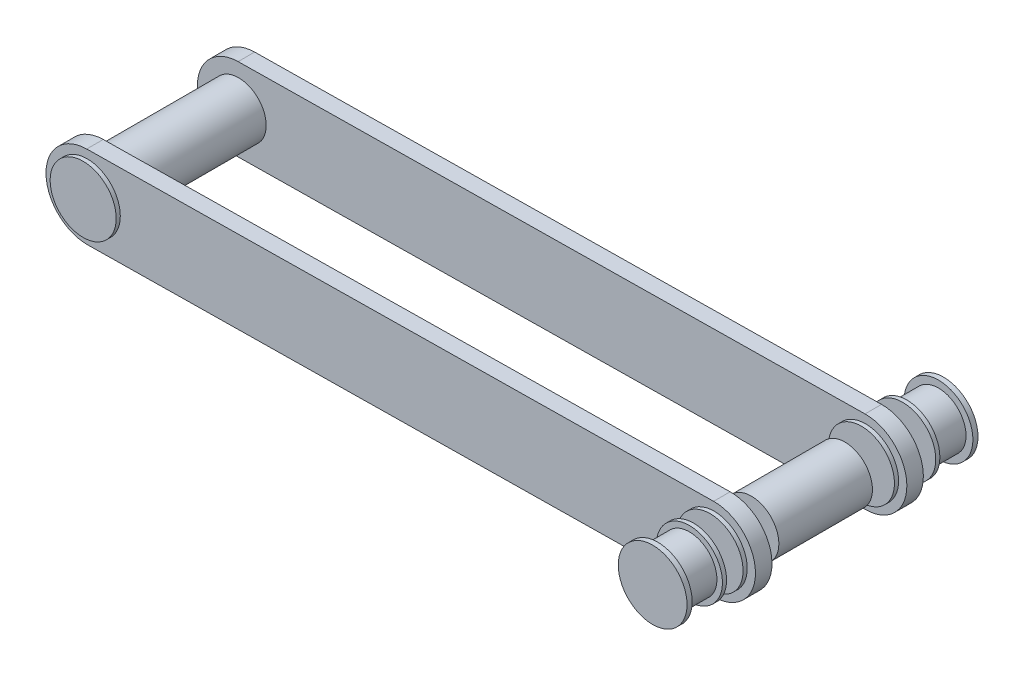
ISO-10303-21;
HEADER;
FILE_DESCRIPTION(('STEP AP214'),'2;1');
FILE_NAME('part.step','',(''),(''),'','','');
FILE_SCHEMA(('AUTOMOTIVE_DESIGN { 1 0 10303 214 1 1 1 1 }'));
ENDSEC;
DATA;
#1=APPLICATION_CONTEXT('core data for automotive mechanical design processes');
#2=APPLICATION_PROTOCOL_DEFINITION('international standard','automotive_design',2000,#1);
#3=PRODUCT_CONTEXT('',#1,'mechanical');
#4=PRODUCT('Part','Part','',(#3));
#5=PRODUCT_RELATED_PRODUCT_CATEGORY('part','',(#4));
#6=PRODUCT_DEFINITION_FORMATION('','',#4);
#7=PRODUCT_DEFINITION_CONTEXT('part definition',#1,'design');
#8=PRODUCT_DEFINITION('design','',#6,#7);
#9=PRODUCT_DEFINITION_SHAPE('','',#8);
#10=(LENGTH_UNIT() NAMED_UNIT(*) SI_UNIT(.MILLI.,.METRE.));
#11=(NAMED_UNIT(*) PLANE_ANGLE_UNIT() SI_UNIT($,.RADIAN.));
#12=(NAMED_UNIT(*) SI_UNIT($,.STERADIAN.) SOLID_ANGLE_UNIT());
#13=UNCERTAINTY_MEASURE_WITH_UNIT(LENGTH_MEASURE(1.E-05),#10,'distance_accuracy_value','');
#14=(GEOMETRIC_REPRESENTATION_CONTEXT(3) GLOBAL_UNCERTAINTY_ASSIGNED_CONTEXT((#13)) GLOBAL_UNIT_ASSIGNED_CONTEXT((#10,
#11,#12)) REPRESENTATION_CONTEXT('',''));
#15=CARTESIAN_POINT('',(0.,0.,0.));
#16=DIRECTION('',(0.,0.,1.));
#17=DIRECTION('',(1.,0.,0.));
#18=AXIS2_PLACEMENT_3D('',#15,#16,#17);
#19=CARTESIAN_POINT('',(244.185614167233,302.725459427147,50.9999999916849));
#20=DIRECTION('',(0.,0.,1.));
#21=DIRECTION('',(1.,0.,0.));
#22=AXIS2_PLACEMENT_3D('',#19,#20,#21);
#23=PLANE('',#22);
#24=CARTESIAN_POINT('',(244.185614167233,302.725459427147,50.9999999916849));
#25=DIRECTION('',(0.,0.,-1.));
#26=DIRECTION('',(-1.,0.,0.));
#27=AXIS2_PLACEMENT_3D('',#24,#25,#26);
#28=CIRCLE('',#27,10.0000004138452);
#29=CARTESIAN_POINT('',(234.185613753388,302.725459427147,50.9999999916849));
#30=VERTEX_POINT('',#29);
#31=EDGE_CURVE('P0_E10',#30,#30,#28,.T.);
#32=ORIENTED_EDGE('',*,*,#31,.F.);
#33=EDGE_LOOP('',(#32));
#34=FACE_BOUND('',#33,.T.);
#35=ADVANCED_FACE('P0_F14',(#34),#23,.T.);
#36=CARTESIAN_POINT('',(244.185614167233,302.725459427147,39.4999999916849));
#37=DIRECTION('',(0.,0.,-1.));
#38=DIRECTION('',(-1.,0.,0.));
#39=AXIS2_PLACEMENT_3D('',#36,#37,#38);
#40=PLANE('',#39);
#41=CARTESIAN_POINT('',(244.185614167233,302.725459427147,39.4999999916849));
#42=DIRECTION('',(0.,0.,1.));
#43=DIRECTION('',(1.,0.,0.));
#44=AXIS2_PLACEMENT_3D('',#41,#42,#43);
#45=CIRCLE('',#44,10.0000004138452);
#46=CARTESIAN_POINT('',(254.185614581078,302.725459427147,39.4999999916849));
#47=VERTEX_POINT('',#46);
#48=EDGE_CURVE('P0_E21',#47,#47,#45,.T.);
#49=ORIENTED_EDGE('',*,*,#48,.F.);
#50=EDGE_LOOP('',(#49));
#51=FACE_BOUND('',#50,.T.);
#52=ADVANCED_FACE('P0_F28',(#51),#40,.T.);
#53=CARTESIAN_POINT('',(244.185614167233,302.725459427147,39.4999999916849));
#54=DIRECTION('',(0.,0.,1.));
#55=DIRECTION('',(1.,0.,0.));
#56=AXIS2_PLACEMENT_3D('',#53,#54,#55);
#57=CYLINDRICAL_SURFACE('',#56,10.0000004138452);
#58=ORIENTED_EDGE('',*,*,#31,.T.);
#59=EDGE_LOOP('',(#58));
#60=FACE_BOUND('',#59,.T.);
#61=ORIENTED_EDGE('',*,*,#48,.T.);
#62=EDGE_LOOP('',(#61));
#63=FACE_BOUND('',#62,.T.);
#64=ADVANCED_FACE('P0_F16',(#60,#63),#57,.T.);
#65=CLOSED_SHELL('',(#35,#52,#64));
#66=MANIFOLD_SOLID_BREP('P0_B1',#65);
#67=CARTESIAN_POINT('',(244.185614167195,302.725459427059,-24.5000000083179));
#68=DIRECTION('',(0.,0.,-1.));
#69=DIRECTION('',(-1.,0.,0.));
#70=AXIS2_PLACEMENT_3D('',#67,#68,#69);
#71=PLANE('',#70);
#72=CARTESIAN_POINT('',(244.185614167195,302.725459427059,-24.5000000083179));
#73=DIRECTION('',(0.,0.,1.));
#74=DIRECTION('',(1.,0.,0.));
#75=AXIS2_PLACEMENT_3D('',#72,#73,#74);
#76=CIRCLE('',#75,12.0000004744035);
#77=CARTESIAN_POINT('',(256.185614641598,302.725459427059,-24.5000000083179));
#78=VERTEX_POINT('',#77);
#79=EDGE_CURVE('P1_E10',#78,#78,#76,.T.);
#80=ORIENTED_EDGE('',*,*,#79,.F.);
#81=EDGE_LOOP('',(#80));
#82=FACE_BOUND('',#81,.T.);
#83=ADVANCED_FACE('P1_F14',(#82),#71,.T.);
#84=CARTESIAN_POINT('',(244.185614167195,302.725459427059,-23.0000000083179));
#85=DIRECTION('',(0.,0.,1.));
#86=DIRECTION('',(1.,0.,0.));
#87=AXIS2_PLACEMENT_3D('',#84,#85,#86);
#88=PLANE('',#87);
#89=CARTESIAN_POINT('',(244.185614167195,302.725459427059,-23.0000000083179));
#90=DIRECTION('',(0.,0.,-1.));
#91=DIRECTION('',(-1.,0.,0.));
#92=AXIS2_PLACEMENT_3D('',#89,#90,#91);
#93=CIRCLE('',#92,12.0000004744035);
#94=CARTESIAN_POINT('',(232.185613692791,302.725459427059,-23.000000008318));
#95=VERTEX_POINT('',#94);
#96=EDGE_CURVE('P1_E21',#95,#95,#93,.T.);
#97=ORIENTED_EDGE('',*,*,#96,.F.);
#98=EDGE_LOOP('',(#97));
#99=FACE_BOUND('',#98,.T.);
#100=ADVANCED_FACE('P1_F28',(#99),#88,.T.);
#101=CARTESIAN_POINT('',(244.185614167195,302.725459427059,-23.0000000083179));
#102=DIRECTION('',(0.,0.,-1.));
#103=DIRECTION('',(-1.,0.,0.));
#104=AXIS2_PLACEMENT_3D('',#101,#102,#103);
#105=CYLINDRICAL_SURFACE('',#104,12.0000004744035);
#106=ORIENTED_EDGE('',*,*,#79,.T.);
#107=EDGE_LOOP('',(#106));
#108=FACE_BOUND('',#107,.T.);
#109=ORIENTED_EDGE('',*,*,#96,.T.);
#110=EDGE_LOOP('',(#109));
#111=FACE_BOUND('',#110,.T.);
#112=ADVANCED_FACE('P1_F16',(#108,#111),#105,.T.);
#113=CLOSED_SHELL('',(#83,#100,#112));
#114=MANIFOLD_SOLID_BREP('P1_B1',#113);
#115=CARTESIAN_POINT('',(244.185614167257,302.725459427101,16.9999999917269));
#116=DIRECTION('',(0.,0.,1.));
#117=DIRECTION('',(1.,0.,0.));
#118=AXIS2_PLACEMENT_3D('',#115,#116,#117);
#119=PLANE('',#118);
#120=CARTESIAN_POINT('',(244.185614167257,302.725459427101,16.9999999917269));
#121=DIRECTION('',(0.,0.,-1.));
#122=DIRECTION('',(-1.,0.,0.));
#123=AXIS2_PLACEMENT_3D('',#120,#121,#122);
#124=CIRCLE('',#123,10.0000004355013);
#125=CARTESIAN_POINT('',(234.185613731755,302.725459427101,16.9999999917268));
#126=VERTEX_POINT('',#125);
#127=EDGE_CURVE('P2_E10',#126,#126,#124,.T.);
#128=ORIENTED_EDGE('',*,*,#127,.F.);
#129=EDGE_LOOP('',(#128));
#130=FACE_BOUND('',#129,.T.);
#131=ADVANCED_FACE('P2_F14',(#130),#119,.T.);
#132=CARTESIAN_POINT('',(244.185614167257,302.725459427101,-17.0000000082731));
#133=DIRECTION('',(0.,0.,-1.));
#134=DIRECTION('',(-1.,0.,0.));
#135=AXIS2_PLACEMENT_3D('',#132,#133,#134);
#136=PLANE('',#135);
#137=CARTESIAN_POINT('',(244.185614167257,302.725459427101,-17.0000000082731));
#138=DIRECTION('',(0.,0.,1.));
#139=DIRECTION('',(1.,0.,0.));
#140=AXIS2_PLACEMENT_3D('',#137,#138,#139);
#141=CIRCLE('',#140,10.0000004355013);
#142=CARTESIAN_POINT('',(254.185614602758,302.725459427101,-17.0000000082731));
#143=VERTEX_POINT('',#142);
#144=EDGE_CURVE('P2_E21',#143,#143,#141,.T.);
#145=ORIENTED_EDGE('',*,*,#144,.F.);
#146=EDGE_LOOP('',(#145));
#147=FACE_BOUND('',#146,.T.);
#148=ADVANCED_FACE('P2_F28',(#147),#136,.T.);
#149=CARTESIAN_POINT('',(244.185614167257,302.725459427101,-17.0000000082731));
#150=DIRECTION('',(0.,0.,1.));
#151=DIRECTION('',(1.,0.,0.));
#152=AXIS2_PLACEMENT_3D('',#149,#150,#151);
#153=CYLINDRICAL_SURFACE('',#152,10.0000004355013);
#154=ORIENTED_EDGE('',*,*,#127,.T.);
#155=EDGE_LOOP('',(#154));
#156=FACE_BOUND('',#155,.T.);
#157=ORIENTED_EDGE('',*,*,#144,.T.);
#158=EDGE_LOOP('',(#157));
#159=FACE_BOUND('',#158,.T.);
#160=ADVANCED_FACE('P2_F16',(#156,#159),#153,.T.);
#161=CLOSED_SHELL('',(#131,#148,#160));
#162=MANIFOLD_SOLID_BREP('P2_B1',#161);
#163=CARTESIAN_POINT('',(244.185614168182,302.725459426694,-51.0000000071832));
#164=DIRECTION('',(0.,0.,1.));
#165=DIRECTION('',(1.,0.,0.));
#166=AXIS2_PLACEMENT_3D('',#163,#164,#165);
#167=PLANE('',#166);
#168=CARTESIAN_POINT('',(244.185614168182,302.725459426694,-51.0000000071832));
#169=DIRECTION('',(0.,0.,-1.));
#170=DIRECTION('',(-1.,0.,0.));
#171=AXIS2_PLACEMENT_3D('',#168,#169,#170);
#172=CIRCLE('',#171,12.5000004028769);
#173=CARTESIAN_POINT('',(231.685613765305,302.725459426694,-51.0000000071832));
#174=VERTEX_POINT('',#173);
#175=EDGE_CURVE('P3_E10',#174,#174,#172,.T.);
#176=ORIENTED_EDGE('',*,*,#175,.F.);
#177=EDGE_LOOP('',(#176));
#178=FACE_BOUND('',#177,.T.);
#179=ADVANCED_FACE('P3_F14',(#178),#167,.T.);
#180=CARTESIAN_POINT('',(244.185614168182,302.725459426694,-52.8522413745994));
#181=DIRECTION('',(0.,0.,-1.));
#182=DIRECTION('',(-1.,0.,0.));
#183=AXIS2_PLACEMENT_3D('',#180,#181,#182);
#184=PLANE('',#183);
#185=CARTESIAN_POINT('',(244.185614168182,302.725459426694,-52.8522413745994));
#186=DIRECTION('',(0.,0.,1.));
#187=DIRECTION('',(1.,0.,0.));
#188=AXIS2_PLACEMENT_3D('',#185,#186,#187);
#189=CIRCLE('',#188,12.5000004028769);
#190=CARTESIAN_POINT('',(256.685614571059,302.725459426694,-52.8522413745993));
#191=VERTEX_POINT('',#190);
#192=EDGE_CURVE('P3_E21',#191,#191,#189,.T.);
#193=ORIENTED_EDGE('',*,*,#192,.F.);
#194=EDGE_LOOP('',(#193));
#195=FACE_BOUND('',#194,.T.);
#196=ADVANCED_FACE('P3_F28',(#195),#184,.T.);
#197=CARTESIAN_POINT('',(244.185614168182,302.725459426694,-52.8522413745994));
#198=DIRECTION('',(0.,0.,1.));
#199=DIRECTION('',(1.,0.,0.));
#200=AXIS2_PLACEMENT_3D('',#197,#198,#199);
#201=CYLINDRICAL_SURFACE('',#200,12.5000004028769);
#202=ORIENTED_EDGE('',*,*,#175,.T.);
#203=EDGE_LOOP('',(#202));
#204=FACE_BOUND('',#203,.T.);
#205=ORIENTED_EDGE('',*,*,#192,.T.);
#206=EDGE_LOOP('',(#205));
#207=FACE_BOUND('',#206,.T.);
#208=ADVANCED_FACE('P3_F16',(#204,#207),#201,.T.);
#209=CLOSED_SHELL('',(#179,#196,#208));
#210=MANIFOLD_SOLID_BREP('P3_B1',#209);
#211=CARTESIAN_POINT('',(244.185614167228,302.725459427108,-39.5000000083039));
#212=DIRECTION('',(0.,0.,1.));
#213=DIRECTION('',(1.,0.,0.));
#214=AXIS2_PLACEMENT_3D('',#211,#212,#213);
#215=PLANE('',#214);
#216=CARTESIAN_POINT('',(244.185614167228,302.725459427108,-39.5000000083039));
#217=DIRECTION('',(0.,0.,-1.));
#218=DIRECTION('',(-1.,0.,0.));
#219=AXIS2_PLACEMENT_3D('',#216,#217,#218);
#220=CIRCLE('',#219,10.0000004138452);
#221=CARTESIAN_POINT('',(234.185613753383,302.725459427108,-39.5000000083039));
#222=VERTEX_POINT('',#221);
#223=EDGE_CURVE('P4_E10',#222,#222,#220,.T.);
#224=ORIENTED_EDGE('',*,*,#223,.F.);
#225=EDGE_LOOP('',(#224));
#226=FACE_BOUND('',#225,.T.);
#227=ADVANCED_FACE('P4_F14',(#226),#215,.T.);
#228=CARTESIAN_POINT('',(244.185614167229,302.725459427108,-51.0000000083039));
#229=DIRECTION('',(0.,0.,-1.));
#230=DIRECTION('',(-1.,0.,0.));
#231=AXIS2_PLACEMENT_3D('',#228,#229,#230);
#232=PLANE('',#231);
#233=CARTESIAN_POINT('',(244.185614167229,302.725459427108,-51.0000000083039));
#234=DIRECTION('',(0.,0.,1.));
#235=DIRECTION('',(1.,0.,0.));
#236=AXIS2_PLACEMENT_3D('',#233,#234,#235);
#237=CIRCLE('',#236,10.0000004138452);
#238=CARTESIAN_POINT('',(254.185614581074,302.725459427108,-51.0000000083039));
#239=VERTEX_POINT('',#238);
#240=EDGE_CURVE('P4_E21',#239,#239,#237,.T.);
#241=ORIENTED_EDGE('',*,*,#240,.F.);
#242=EDGE_LOOP('',(#241));
#243=FACE_BOUND('',#242,.T.);
#244=ADVANCED_FACE('P4_F28',(#243),#232,.T.);
#245=CARTESIAN_POINT('',(244.185614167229,302.725459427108,-51.0000000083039));
#246=DIRECTION('',(0.,0.,1.));
#247=DIRECTION('',(1.,0.,0.));
#248=AXIS2_PLACEMENT_3D('',#245,#246,#247);
#249=CYLINDRICAL_SURFACE('',#248,10.0000004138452);
#250=ORIENTED_EDGE('',*,*,#223,.T.);
#251=EDGE_LOOP('',(#250));
#252=FACE_BOUND('',#251,.T.);
#253=ORIENTED_EDGE('',*,*,#240,.T.);
#254=EDGE_LOOP('',(#253));
#255=FACE_BOUND('',#254,.T.);
#256=ADVANCED_FACE('P4_F16',(#252,#255),#249,.T.);
#257=CLOSED_SHELL('',(#227,#244,#256));
#258=MANIFOLD_SOLID_BREP('P4_B1',#257);
#259=CARTESIAN_POINT('',(244.185614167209,302.725459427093,-38.0000000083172));
#260=DIRECTION('',(0.,0.,1.));
#261=DIRECTION('',(1.,0.,0.));
#262=AXIS2_PLACEMENT_3D('',#259,#260,#261);
#263=PLANE('',#262);
#264=CARTESIAN_POINT('',(244.185614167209,302.725459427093,-38.0000000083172));
#265=DIRECTION('',(0.,0.,-1.));
#266=DIRECTION('',(-1.,0.,0.));
#267=AXIS2_PLACEMENT_3D('',#264,#265,#266);
#268=CIRCLE('',#267,12.0000004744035);
#269=CARTESIAN_POINT('',(232.185613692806,302.725459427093,-38.0000000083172));
#270=VERTEX_POINT('',#269);
#271=EDGE_CURVE('P5_E10',#270,#270,#268,.T.);
#272=ORIENTED_EDGE('',*,*,#271,.F.);
#273=EDGE_LOOP('',(#272));
#274=FACE_BOUND('',#273,.T.);
#275=ADVANCED_FACE('P5_F14',(#274),#263,.T.);
#276=CARTESIAN_POINT('',(244.185614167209,302.725459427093,-39.5000000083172));
#277=DIRECTION('',(0.,0.,-1.));
#278=DIRECTION('',(-1.,0.,0.));
#279=AXIS2_PLACEMENT_3D('',#276,#277,#278);
#280=PLANE('',#279);
#281=CARTESIAN_POINT('',(244.185614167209,302.725459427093,-39.5000000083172));
#282=DIRECTION('',(0.,0.,1.));
#283=DIRECTION('',(1.,0.,0.));
#284=AXIS2_PLACEMENT_3D('',#281,#282,#283);
#285=CIRCLE('',#284,12.0000004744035);
#286=CARTESIAN_POINT('',(256.185614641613,302.725459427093,-39.5000000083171));
#287=VERTEX_POINT('',#286);
#288=EDGE_CURVE('P5_E21',#287,#287,#285,.T.);
#289=ORIENTED_EDGE('',*,*,#288,.F.);
#290=EDGE_LOOP('',(#289));
#291=FACE_BOUND('',#290,.T.);
#292=ADVANCED_FACE('P5_F28',(#291),#280,.T.);
#293=CARTESIAN_POINT('',(244.185614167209,302.725459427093,-39.5000000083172));
#294=DIRECTION('',(0.,0.,1.));
#295=DIRECTION('',(1.,0.,0.));
#296=AXIS2_PLACEMENT_3D('',#293,#294,#295);
#297=CYLINDRICAL_SURFACE('',#296,12.0000004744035);
#298=ORIENTED_EDGE('',*,*,#271,.T.);
#299=EDGE_LOOP('',(#298));
#300=FACE_BOUND('',#299,.T.);
#301=ORIENTED_EDGE('',*,*,#288,.T.);
#302=EDGE_LOOP('',(#301));
#303=FACE_BOUND('',#302,.T.);
#304=ADVANCED_FACE('P5_F16',(#300,#303),#297,.T.);
#305=CLOSED_SHELL('',(#275,#292,#304));
#306=MANIFOLD_SOLID_BREP('P5_B1',#305);
#307=CARTESIAN_POINT('',(244.185614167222,302.725459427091,-30.5000000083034));
#308=DIRECTION('',(0.,0.,1.));
#309=DIRECTION('',(1.,0.,0.));
#310=AXIS2_PLACEMENT_3D('',#307,#308,#309);
#311=PLANE('',#310);
#312=CARTESIAN_POINT('',(244.185614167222,302.725459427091,-30.5000000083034));
#313=DIRECTION('',(0.,0.,-1.));
#314=DIRECTION('',(-1.,0.,0.));
#315=AXIS2_PLACEMENT_3D('',#312,#313,#314);
#316=CIRCLE('',#315,12.0000004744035);
#317=CARTESIAN_POINT('',(232.185613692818,302.725459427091,-30.5000000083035));
#318=VERTEX_POINT('',#317);
#319=EDGE_CURVE('P6_E10',#318,#318,#316,.T.);
#320=ORIENTED_EDGE('',*,*,#319,.F.);
#321=EDGE_LOOP('',(#320));
#322=FACE_BOUND('',#321,.T.);
#323=ADVANCED_FACE('P6_F14',(#322),#311,.T.);
#324=CARTESIAN_POINT('',(244.185614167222,302.725459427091,-32.0000000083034));
#325=DIRECTION('',(0.,0.,-1.));
#326=DIRECTION('',(-1.,0.,0.));
#327=AXIS2_PLACEMENT_3D('',#324,#325,#326);
#328=PLANE('',#327);
#329=CARTESIAN_POINT('',(244.185614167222,302.725459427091,-32.0000000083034));
#330=DIRECTION('',(0.,0.,1.));
#331=DIRECTION('',(1.,0.,0.));
#332=AXIS2_PLACEMENT_3D('',#329,#330,#331);
#333=CIRCLE('',#332,12.0000004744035);
#334=CARTESIAN_POINT('',(256.185614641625,302.725459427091,-32.0000000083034));
#335=VERTEX_POINT('',#334);
#336=EDGE_CURVE('P6_E21',#335,#335,#333,.T.);
#337=ORIENTED_EDGE('',*,*,#336,.F.);
#338=EDGE_LOOP('',(#337));
#339=FACE_BOUND('',#338,.T.);
#340=ADVANCED_FACE('P6_F28',(#339),#328,.T.);
#341=CARTESIAN_POINT('',(244.185614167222,302.725459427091,-32.0000000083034));
#342=DIRECTION('',(0.,0.,1.));
#343=DIRECTION('',(1.,0.,0.));
#344=AXIS2_PLACEMENT_3D('',#341,#342,#343);
#345=CYLINDRICAL_SURFACE('',#344,12.0000004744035);
#346=ORIENTED_EDGE('',*,*,#319,.T.);
#347=EDGE_LOOP('',(#346));
#348=FACE_BOUND('',#347,.T.);
#349=ORIENTED_EDGE('',*,*,#336,.T.);
#350=EDGE_LOOP('',(#349));
#351=FACE_BOUND('',#350,.T.);
#352=ADVANCED_FACE('P6_F16',(#348,#351),#345,.T.);
#353=CLOSED_SHELL('',(#323,#340,#352));
#354=MANIFOLD_SOLID_BREP('P6_B1',#353);
#355=CARTESIAN_POINT('',(16.422696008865,299.701239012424,32.0000000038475));
#356=DIRECTION('',(0.,0.,1.));
#357=DIRECTION('',(1.,0.,0.));
#358=AXIS2_PLACEMENT_3D('',#355,#356,#357);
#359=PLANE('',#358);
#360=CARTESIAN_POINT('',(16.422696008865,299.701239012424,32.0000000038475));
#361=DIRECTION('',(0.,0.,-1.));
#362=DIRECTION('',(-1.,0.,0.));
#363=AXIS2_PLACEMENT_3D('',#360,#361,#362);
#364=CIRCLE('',#363,12.0000004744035);
#365=CARTESIAN_POINT('',(4.42269553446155,299.701239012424,32.0000000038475));
#366=VERTEX_POINT('',#365);
#367=EDGE_CURVE('P7_E10',#366,#366,#364,.T.);
#368=ORIENTED_EDGE('',*,*,#367,.F.);
#369=EDGE_LOOP('',(#368));
#370=FACE_BOUND('',#369,.T.);
#371=ADVANCED_FACE('P7_F14',(#370),#359,.T.);
#372=CARTESIAN_POINT('',(16.422696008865,299.701239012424,30.5000000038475));
#373=DIRECTION('',(0.,0.,-1.));
#374=DIRECTION('',(-1.,0.,0.));
#375=AXIS2_PLACEMENT_3D('',#372,#373,#374);
#376=PLANE('',#375);
#377=CARTESIAN_POINT('',(16.422696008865,299.701239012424,30.5000000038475));
#378=DIRECTION('',(0.,0.,1.));
#379=DIRECTION('',(1.,0.,0.));
#380=AXIS2_PLACEMENT_3D('',#377,#378,#379);
#381=CIRCLE('',#380,12.0000004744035);
#382=CARTESIAN_POINT('',(28.4226964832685,299.701239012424,30.5000000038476));
#383=VERTEX_POINT('',#382);
#384=EDGE_CURVE('P7_E21',#383,#383,#381,.T.);
#385=ORIENTED_EDGE('',*,*,#384,.F.);
#386=EDGE_LOOP('',(#385));
#387=FACE_BOUND('',#386,.T.);
#388=ADVANCED_FACE('P7_F28',(#387),#376,.T.);
#389=CARTESIAN_POINT('',(16.422696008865,299.701239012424,30.5000000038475));
#390=DIRECTION('',(0.,0.,1.));
#391=DIRECTION('',(1.,0.,0.));
#392=AXIS2_PLACEMENT_3D('',#389,#390,#391);
#393=CYLINDRICAL_SURFACE('',#392,12.0000004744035);
#394=ORIENTED_EDGE('',*,*,#367,.T.);
#395=EDGE_LOOP('',(#394));
#396=FACE_BOUND('',#395,.T.);
#397=ORIENTED_EDGE('',*,*,#384,.T.);
#398=EDGE_LOOP('',(#397));
#399=FACE_BOUND('',#398,.T.);
#400=ADVANCED_FACE('P7_F16',(#396,#399),#393,.T.);
#401=CLOSED_SHELL('',(#371,#388,#400));
#402=MANIFOLD_SOLID_BREP('P7_B1',#401);
#403=CARTESIAN_POINT('',(16.4226960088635,299.701239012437,-24.4999999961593));
#404=DIRECTION('',(0.,0.,-1.));
#405=DIRECTION('',(-1.,0.,0.));
#406=AXIS2_PLACEMENT_3D('',#403,#404,#405);
#407=PLANE('',#406);
#408=CARTESIAN_POINT('',(16.4226960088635,299.701239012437,-24.4999999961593));
#409=DIRECTION('',(0.,0.,1.));
#410=DIRECTION('',(1.,0.,0.));
#411=AXIS2_PLACEMENT_3D('',#408,#409,#410);
#412=CIRCLE('',#411,10.0000004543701);
#413=CARTESIAN_POINT('',(26.4226964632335,299.701239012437,-24.4999999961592));
#414=VERTEX_POINT('',#413);
#415=EDGE_CURVE('P8_E10',#414,#414,#412,.T.);
#416=ORIENTED_EDGE('',*,*,#415,.F.);
#417=EDGE_LOOP('',(#416));
#418=FACE_BOUND('',#417,.T.);
#419=ADVANCED_FACE('P8_F14',(#418),#407,.T.);
#420=CARTESIAN_POINT('',(16.4226960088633,299.701239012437,24.5000000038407));
#421=DIRECTION('',(0.,0.,1.));
#422=DIRECTION('',(1.,0.,0.));
#423=AXIS2_PLACEMENT_3D('',#420,#421,#422);
#424=PLANE('',#423);
#425=CARTESIAN_POINT('',(16.4226960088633,299.701239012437,24.5000000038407));
#426=DIRECTION('',(0.,0.,-1.));
#427=DIRECTION('',(-1.,0.,0.));
#428=AXIS2_PLACEMENT_3D('',#425,#426,#427);
#429=CIRCLE('',#428,10.0000004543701);
#430=CARTESIAN_POINT('',(6.42269555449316,299.701239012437,24.5000000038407));
#431=VERTEX_POINT('',#430);
#432=EDGE_CURVE('P8_E21',#431,#431,#429,.T.);
#433=ORIENTED_EDGE('',*,*,#432,.F.);
#434=EDGE_LOOP('',(#433));
#435=FACE_BOUND('',#434,.T.);
#436=ADVANCED_FACE('P8_F28',(#435),#424,.T.);
#437=CARTESIAN_POINT('',(16.4226960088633,299.701239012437,24.5000000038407));
#438=DIRECTION('',(0.,0.,-1.));
#439=DIRECTION('',(-1.,0.,0.));
#440=AXIS2_PLACEMENT_3D('',#437,#438,#439);
#441=CYLINDRICAL_SURFACE('',#440,10.0000004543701);
#442=ORIENTED_EDGE('',*,*,#415,.T.);
#443=EDGE_LOOP('',(#442));
#444=FACE_BOUND('',#443,.T.);
#445=ORIENTED_EDGE('',*,*,#432,.T.);
#446=EDGE_LOOP('',(#445));
#447=FACE_BOUND('',#446,.T.);
#448=ADVANCED_FACE('P8_F16',(#444,#447),#441,.T.);
#449=CLOSED_SHELL('',(#419,#436,#448));
#450=MANIFOLD_SOLID_BREP('P8_B1',#449);
#451=CARTESIAN_POINT('',(16.4226960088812,299.701239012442,-30.4999999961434));
#452=DIRECTION('',(0.,0.,1.));
#453=DIRECTION('',(1.,0.,0.));
#454=AXIS2_PLACEMENT_3D('',#451,#452,#453);
#455=PLANE('',#454);
#456=CARTESIAN_POINT('',(16.4226960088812,299.701239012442,-30.4999999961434));
#457=DIRECTION('',(0.,0.,-1.));
#458=DIRECTION('',(-1.,0.,0.));
#459=AXIS2_PLACEMENT_3D('',#456,#457,#458);
#460=CIRCLE('',#459,12.0000004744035);
#461=CARTESIAN_POINT('',(4.42269553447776,299.701239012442,-30.4999999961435));
#462=VERTEX_POINT('',#461);
#463=EDGE_CURVE('P9_E10',#462,#462,#460,.T.);
#464=ORIENTED_EDGE('',*,*,#463,.F.);
#465=EDGE_LOOP('',(#464));
#466=FACE_BOUND('',#465,.T.);
#467=ADVANCED_FACE('P9_F14',(#466),#455,.T.);
#468=CARTESIAN_POINT('',(16.4226960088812,299.701239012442,-31.9999999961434));
#469=DIRECTION('',(0.,0.,-1.));
#470=DIRECTION('',(-1.,0.,0.));
#471=AXIS2_PLACEMENT_3D('',#468,#469,#470);
#472=PLANE('',#471);
#473=CARTESIAN_POINT('',(16.4226960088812,299.701239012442,-31.9999999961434));
#474=DIRECTION('',(0.,0.,1.));
#475=DIRECTION('',(1.,0.,0.));
#476=AXIS2_PLACEMENT_3D('',#473,#474,#475);
#477=CIRCLE('',#476,12.0000004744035);
#478=CARTESIAN_POINT('',(28.4226964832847,299.701239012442,-31.9999999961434));
#479=VERTEX_POINT('',#478);
#480=EDGE_CURVE('P9_E21',#479,#479,#477,.T.);
#481=ORIENTED_EDGE('',*,*,#480,.F.);
#482=EDGE_LOOP('',(#481));
#483=FACE_BOUND('',#482,.T.);
#484=ADVANCED_FACE('P9_F28',(#483),#472,.T.);
#485=CARTESIAN_POINT('',(16.4226960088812,299.701239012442,-31.9999999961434));
#486=DIRECTION('',(0.,0.,1.));
#487=DIRECTION('',(1.,0.,0.));
#488=AXIS2_PLACEMENT_3D('',#485,#486,#487);
#489=CYLINDRICAL_SURFACE('',#488,12.0000004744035);
#490=ORIENTED_EDGE('',*,*,#463,.T.);
#491=EDGE_LOOP('',(#490));
#492=FACE_BOUND('',#491,.T.);
#493=ORIENTED_EDGE('',*,*,#480,.T.);
#494=EDGE_LOOP('',(#493));
#495=FACE_BOUND('',#494,.T.);
#496=ADVANCED_FACE('P9_F16',(#492,#495),#489,.T.);
#497=CLOSED_SHELL('',(#467,#484,#496));
#498=MANIFOLD_SOLID_BREP('P9_B1',#497);
#499=CARTESIAN_POINT('',(243.98646273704,317.724137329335,-24.5000000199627));
#500=DIRECTION('',(-0.0132767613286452,0.999911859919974,1.70892867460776E-12));
#501=DIRECTION('',(-0.999911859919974,-0.0132767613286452,0.));
#502=AXIS2_PLACEMENT_3D('',#499,#500,#501);
#503=PLANE('',#502);
#504=DIRECTION('',(0.999911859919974,0.0132767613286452,0.));
#505=VECTOR('',#504,1.);
#506=CARTESIAN_POINT('',(243.98646273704,317.724137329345,-30.5000000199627));
#507=LINE('',#506,#505);
#508=CARTESIAN_POINT('',(16.2235445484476,314.699916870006,-30.5000000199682));
#509=VERTEX_POINT('',#508);
#510=CARTESIAN_POINT('',(243.98646273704,317.724137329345,-30.5000000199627));
#511=VERTEX_POINT('',#510);
#512=EDGE_CURVE('P10_E83',#509,#511,#507,.T.);
#513=ORIENTED_EDGE('',*,*,#512,.F.);
#514=DIRECTION('',(0.,1.70909979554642E-12,-1.));
#515=VECTOR('',#514,1.);
#516=CARTESIAN_POINT('',(16.2235445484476,314.699916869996,-24.5000000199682));
#517=LINE('',#516,#515);
#518=CARTESIAN_POINT('',(16.2235445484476,314.699916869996,-24.5000000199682));
#519=VERTEX_POINT('',#518);
#520=EDGE_CURVE('P10_E49',#519,#509,#517,.T.);
#521=ORIENTED_EDGE('',*,*,#520,.F.);
#522=DIRECTION('',(0.999911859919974,0.0132767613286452,0.));
#523=VECTOR('',#522,1.);
#524=CARTESIAN_POINT('',(243.98646273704,317.724137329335,-24.5000000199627));
#525=LINE('',#524,#523);
#526=CARTESIAN_POINT('',(243.98646273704,317.724137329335,-24.5000000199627));
#527=VERTEX_POINT('',#526);
#528=EDGE_CURVE('P10_E74',#519,#527,#525,.T.);
#529=ORIENTED_EDGE('',*,*,#528,.T.);
#530=DIRECTION('',(0.,1.70909979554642E-12,-1.));
#531=VECTOR('',#530,1.);
#532=CARTESIAN_POINT('',(243.98646273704,317.724137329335,-24.5000000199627));
#533=LINE('',#532,#531);
#534=EDGE_CURVE('P10_E11',#527,#511,#533,.T.);
#535=ORIENTED_EDGE('',*,*,#534,.T.);
#536=EDGE_LOOP('',(#513,#521,#529,#535));
#537=FACE_BOUND('',#536,.T.);
#538=ADVANCED_FACE('P10_F16',(#537),#503,.T.);
#539=CARTESIAN_POINT('',(244.18561415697,302.725459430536,-24.5000000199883));
#540=DIRECTION('',(0.,1.70909979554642E-12,-1.));
#541=DIRECTION('',(0.,1.,1.70909979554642E-12));
#542=AXIS2_PLACEMENT_3D('',#539,#540,#541);
#543=CYLINDRICAL_SURFACE('',#542,15.);
#544=CARTESIAN_POINT('',(244.18561415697,302.725459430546,-30.5000000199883));
#545=DIRECTION('',(0.,1.70909979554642E-12,-1.));
#546=DIRECTION('',(0.,-1.,-1.70909979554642E-12));
#547=AXIS2_PLACEMENT_3D('',#544,#545,#546);
#548=CIRCLE('',#547,15.);
#549=CARTESIAN_POINT('',(244.384765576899,287.726781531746,-30.500000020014));
#550=VERTEX_POINT('',#549);
#551=EDGE_CURVE('P10_E71',#511,#550,#548,.T.);
#552=ORIENTED_EDGE('',*,*,#551,.F.);
#553=ORIENTED_EDGE('',*,*,#534,.F.);
#554=CARTESIAN_POINT('',(244.18561415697,302.725459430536,-24.5000000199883));
#555=DIRECTION('',(0.,1.70909979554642E-12,-1.));
#556=DIRECTION('',(0.,-1.,-1.70909979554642E-12));
#557=AXIS2_PLACEMENT_3D('',#554,#555,#556);
#558=CIRCLE('',#557,15.);
#559=CARTESIAN_POINT('',(244.384765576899,287.726781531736,-24.500000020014));
#560=VERTEX_POINT('',#559);
#561=EDGE_CURVE('P10_E76',#527,#560,#558,.T.);
#562=ORIENTED_EDGE('',*,*,#561,.T.);
#563=DIRECTION('',(0.,1.70909979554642E-12,-1.));
#564=VECTOR('',#563,1.);
#565=CARTESIAN_POINT('',(244.384765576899,287.726781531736,-24.500000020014));
#566=LINE('',#565,#564);
#567=EDGE_CURVE('P10_E20',#560,#550,#566,.T.);
#568=ORIENTED_EDGE('',*,*,#567,.T.);
#569=EDGE_LOOP('',(#552,#553,#562,#568));
#570=FACE_BOUND('',#569,.T.);
#571=ADVANCED_FACE('P10_F90',(#570),#543,.T.);
#572=CARTESIAN_POINT('',(244.384765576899,287.726781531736,-24.500000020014));
#573=DIRECTION('',(0.0132767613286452,-0.999911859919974,-1.70892867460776E-12));
#574=DIRECTION('',(0.999911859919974,0.0132767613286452,0.));
#575=AXIS2_PLACEMENT_3D('',#572,#573,#574);
#576=PLANE('',#575);
#577=DIRECTION('',(-0.999911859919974,-0.0132767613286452,0.));
#578=VECTOR('',#577,1.);
#579=CARTESIAN_POINT('',(244.384765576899,287.726781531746,-30.500000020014));
#580=LINE('',#579,#578);
#581=CARTESIAN_POINT('',(16.621847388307,284.702561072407,-30.5000000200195));
#582=VERTEX_POINT('',#581);
#583=EDGE_CURVE('P10_E80',#550,#582,#580,.T.);
#584=ORIENTED_EDGE('',*,*,#583,.F.);
#585=ORIENTED_EDGE('',*,*,#567,.F.);
#586=DIRECTION('',(-0.999911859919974,-0.0132767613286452,0.));
#587=VECTOR('',#586,1.);
#588=CARTESIAN_POINT('',(244.384765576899,287.726781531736,-24.500000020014));
#589=LINE('',#588,#587);
#590=CARTESIAN_POINT('',(16.621847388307,284.702561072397,-24.5000000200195));
#591=VERTEX_POINT('',#590);
#592=EDGE_CURVE('P10_E69',#560,#591,#589,.T.);
#593=ORIENTED_EDGE('',*,*,#592,.T.);
#594=DIRECTION('',(0.,1.70909979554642E-12,-1.));
#595=VECTOR('',#594,1.);
#596=CARTESIAN_POINT('',(16.621847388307,284.702561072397,-24.5000000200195));
#597=LINE('',#596,#595);
#598=EDGE_CURVE('P10_E61',#591,#582,#597,.T.);
#599=ORIENTED_EDGE('',*,*,#598,.T.);
#600=EDGE_LOOP('',(#584,#585,#593,#599));
#601=FACE_BOUND('',#600,.T.);
#602=ADVANCED_FACE('P10_F18',(#601),#576,.T.);
#603=CARTESIAN_POINT('',(16.4226959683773,299.701238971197,-24.5000000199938));
#604=DIRECTION('',(0.,1.70909979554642E-12,-1.));
#605=DIRECTION('',(0.,1.,1.70909979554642E-12));
#606=AXIS2_PLACEMENT_3D('',#603,#604,#605);
#607=CYLINDRICAL_SURFACE('',#606,15.);
#608=CARTESIAN_POINT('',(16.4226959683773,299.701238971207,-30.5000000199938));
#609=DIRECTION('',(0.,1.70909979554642E-12,-1.));
#610=DIRECTION('',(0.,-1.,-1.70909979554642E-12));
#611=AXIS2_PLACEMENT_3D('',#608,#609,#610);
#612=CIRCLE('',#611,15.);
#613=EDGE_CURVE('P10_E66',#582,#509,#612,.T.);
#614=ORIENTED_EDGE('',*,*,#613,.F.);
#615=ORIENTED_EDGE('',*,*,#598,.F.);
#616=CARTESIAN_POINT('',(16.4226959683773,299.701238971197,-24.5000000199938));
#617=DIRECTION('',(0.,1.70909979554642E-12,-1.));
#618=DIRECTION('',(0.,-1.,-1.70909979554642E-12));
#619=AXIS2_PLACEMENT_3D('',#616,#617,#618);
#620=CIRCLE('',#619,15.);
#621=EDGE_CURVE('P10_E64',#591,#519,#620,.T.);
#622=ORIENTED_EDGE('',*,*,#621,.T.);
#623=ORIENTED_EDGE('',*,*,#520,.T.);
#624=EDGE_LOOP('',(#614,#615,#622,#623));
#625=FACE_BOUND('',#624,.T.);
#626=ADVANCED_FACE('P10_F62',(#625),#607,.T.);
#627=CARTESIAN_POINT('',(130.304155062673,301.213349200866,-24.5000000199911));
#628=DIRECTION('',(0.,1.70910139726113E-12,-1.));
#629=DIRECTION('',(0.,1.,1.70910139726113E-12));
#630=AXIS2_PLACEMENT_3D('',#627,#628,#629);
#631=PLANE('',#630);
#632=ORIENTED_EDGE('',*,*,#528,.F.);
#633=ORIENTED_EDGE('',*,*,#621,.F.);
#634=ORIENTED_EDGE('',*,*,#592,.F.);
#635=ORIENTED_EDGE('',*,*,#561,.F.);
#636=EDGE_LOOP('',(#632,#633,#634,#635));
#637=FACE_BOUND('',#636,.T.);
#638=ADVANCED_FACE('P10_F73',(#637),#631,.F.);
#639=CARTESIAN_POINT('',(130.304155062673,301.213349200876,-30.5000000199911));
#640=DIRECTION('',(0.,1.70910139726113E-12,-1.));
#641=DIRECTION('',(0.,1.,1.70910139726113E-12));
#642=AXIS2_PLACEMENT_3D('',#639,#640,#641);
#643=PLANE('',#642);
#644=ORIENTED_EDGE('',*,*,#512,.T.);
#645=ORIENTED_EDGE('',*,*,#551,.T.);
#646=ORIENTED_EDGE('',*,*,#583,.T.);
#647=ORIENTED_EDGE('',*,*,#613,.T.);
#648=EDGE_LOOP('',(#644,#645,#646,#647));
#649=FACE_BOUND('',#648,.T.);
#650=ADVANCED_FACE('P10_F89',(#649),#643,.T.);
#651=CLOSED_SHELL('',(#538,#571,#602,#626,#638,#650));
#652=MANIFOLD_SOLID_BREP('P10_B1',#651);
#653=CARTESIAN_POINT('',(16.2235445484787,314.699916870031,30.4999999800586));
#654=DIRECTION('',(-0.0132767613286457,0.999911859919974,1.70886033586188E-12));
#655=DIRECTION('',(-0.999911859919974,-0.0132767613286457,0.));
#656=AXIS2_PLACEMENT_3D('',#653,#654,#655);
#657=PLANE('',#656);
#658=DIRECTION('',(0.999911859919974,0.0132767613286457,0.));
#659=VECTOR('',#658,1.);
#660=CARTESIAN_POINT('',(16.2235445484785,314.699916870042,24.4999999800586));
#661=LINE('',#660,#659);
#662=CARTESIAN_POINT('',(16.2235445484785,314.699916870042,24.4999999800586));
#663=VERTEX_POINT('',#662);
#664=CARTESIAN_POINT('',(243.986462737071,317.724137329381,24.4999999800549));
#665=VERTEX_POINT('',#664);
#666=EDGE_CURVE('P11_E83',#663,#665,#661,.T.);
#667=ORIENTED_EDGE('',*,*,#666,.F.);
#668=DIRECTION('',(0.,1.70849234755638E-12,-1.));
#669=VECTOR('',#668,1.);
#670=CARTESIAN_POINT('',(16.2235445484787,314.699916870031,30.4999999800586));
#671=LINE('',#670,#669);
#672=CARTESIAN_POINT('',(16.2235445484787,314.699916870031,30.4999999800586));
#673=VERTEX_POINT('',#672);
#674=EDGE_CURVE('P11_E49',#673,#663,#671,.T.);
#675=ORIENTED_EDGE('',*,*,#674,.F.);
#676=DIRECTION('',(0.999911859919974,0.0132767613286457,0.));
#677=VECTOR('',#676,1.);
#678=CARTESIAN_POINT('',(16.2235445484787,314.699916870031,30.4999999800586));
#679=LINE('',#678,#677);
#680=CARTESIAN_POINT('',(243.986462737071,317.72413732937,30.4999999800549));
#681=VERTEX_POINT('',#680);
#682=EDGE_CURVE('P11_E74',#673,#681,#679,.T.);
#683=ORIENTED_EDGE('',*,*,#682,.T.);
#684=DIRECTION('',(0.,1.70849234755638E-12,-1.));
#685=VECTOR('',#684,1.);
#686=CARTESIAN_POINT('',(243.986462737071,317.72413732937,30.4999999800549));
#687=LINE('',#686,#685);
#688=EDGE_CURVE('P11_E11',#681,#665,#687,.T.);
#689=ORIENTED_EDGE('',*,*,#688,.T.);
#690=EDGE_LOOP('',(#667,#675,#683,#689));
#691=FACE_BOUND('',#690,.T.);
#692=ADVANCED_FACE('P11_F16',(#691),#657,.T.);
#693=CARTESIAN_POINT('',(244.185614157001,302.725459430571,30.4999999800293));
#694=DIRECTION('',(0.,1.70849234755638E-12,-1.));
#695=DIRECTION('',(0.,1.,1.70849234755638E-12));
#696=AXIS2_PLACEMENT_3D('',#693,#694,#695);
#697=CYLINDRICAL_SURFACE('',#696,15.);
#698=CARTESIAN_POINT('',(244.185614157,302.725459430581,24.4999999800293));
#699=DIRECTION('',(0.,1.70849234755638E-12,-1.));
#700=DIRECTION('',(0.,-1.,-1.70849234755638E-12));
#701=AXIS2_PLACEMENT_3D('',#698,#699,#700);
#702=CIRCLE('',#701,15.);
#703=CARTESIAN_POINT('',(244.38476557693,287.726781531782,24.4999999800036));
#704=VERTEX_POINT('',#703);
#705=EDGE_CURVE('P11_E71',#665,#704,#702,.T.);
#706=ORIENTED_EDGE('',*,*,#705,.F.);
#707=ORIENTED_EDGE('',*,*,#688,.F.);
#708=CARTESIAN_POINT('',(244.185614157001,302.725459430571,30.4999999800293));
#709=DIRECTION('',(0.,1.70849234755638E-12,-1.));
#710=DIRECTION('',(0.,-1.,-1.70849234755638E-12));
#711=AXIS2_PLACEMENT_3D('',#708,#709,#710);
#712=CIRCLE('',#711,15.);
#713=CARTESIAN_POINT('',(244.38476557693,287.726781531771,30.4999999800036));
#714=VERTEX_POINT('',#713);
#715=EDGE_CURVE('P11_E76',#681,#714,#712,.T.);
#716=ORIENTED_EDGE('',*,*,#715,.T.);
#717=DIRECTION('',(0.,1.70849234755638E-12,-1.));
#718=VECTOR('',#717,1.);
#719=CARTESIAN_POINT('',(244.38476557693,287.726781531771,30.4999999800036));
#720=LINE('',#719,#718);
#721=EDGE_CURVE('P11_E20',#714,#704,#720,.T.);
#722=ORIENTED_EDGE('',*,*,#721,.T.);
#723=EDGE_LOOP('',(#706,#707,#716,#722));
#724=FACE_BOUND('',#723,.T.);
#725=ADVANCED_FACE('P11_F90',(#724),#697,.T.);
#726=CARTESIAN_POINT('',(244.38476557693,287.726781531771,30.4999999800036));
#727=DIRECTION('',(0.0132767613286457,-0.999911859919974,-1.70886033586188E-12));
#728=DIRECTION('',(0.999911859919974,0.0132767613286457,0.));
#729=AXIS2_PLACEMENT_3D('',#726,#727,#728);
#730=PLANE('',#729);
#731=DIRECTION('',(-0.999911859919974,-0.0132767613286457,0.));
#732=VECTOR('',#731,1.);
#733=CARTESIAN_POINT('',(244.38476557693,287.726781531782,24.4999999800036));
#734=LINE('',#733,#732);
#735=CARTESIAN_POINT('',(16.6218473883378,284.702561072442,24.4999999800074));
#736=VERTEX_POINT('',#735);
#737=EDGE_CURVE('P11_E80',#704,#736,#734,.T.);
#738=ORIENTED_EDGE('',*,*,#737,.F.);
#739=ORIENTED_EDGE('',*,*,#721,.F.);
#740=DIRECTION('',(-0.999911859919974,-0.0132767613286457,0.));
#741=VECTOR('',#740,1.);
#742=CARTESIAN_POINT('',(244.38476557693,287.726781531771,30.4999999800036));
#743=LINE('',#742,#741);
#744=CARTESIAN_POINT('',(16.621847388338,284.702561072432,30.4999999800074));
#745=VERTEX_POINT('',#744);
#746=EDGE_CURVE('P11_E69',#714,#745,#743,.T.);
#747=ORIENTED_EDGE('',*,*,#746,.T.);
#748=DIRECTION('',(0.,1.70849234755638E-12,-1.));
#749=VECTOR('',#748,1.);
#750=CARTESIAN_POINT('',(16.621847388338,284.702561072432,30.4999999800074));
#751=LINE('',#750,#749);
#752=EDGE_CURVE('P11_E61',#745,#736,#751,.T.);
#753=ORIENTED_EDGE('',*,*,#752,.T.);
#754=EDGE_LOOP('',(#738,#739,#747,#753));
#755=FACE_BOUND('',#754,.T.);
#756=ADVANCED_FACE('P11_F18',(#755),#730,.T.);
#757=CARTESIAN_POINT('',(16.4226959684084,299.701238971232,30.499999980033));
#758=DIRECTION('',(0.,1.70849234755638E-12,-1.));
#759=DIRECTION('',(0.,1.,1.70849234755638E-12));
#760=AXIS2_PLACEMENT_3D('',#757,#758,#759);
#761=CYLINDRICAL_SURFACE('',#760,15.);
#762=CARTESIAN_POINT('',(16.4226959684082,299.701238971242,24.499999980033));
#763=DIRECTION('',(0.,1.70849234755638E-12,-1.));
#764=DIRECTION('',(0.,-1.,-1.70849234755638E-12));
#765=AXIS2_PLACEMENT_3D('',#762,#763,#764);
#766=CIRCLE('',#765,15.);
#767=EDGE_CURVE('P11_E66',#736,#663,#766,.T.);
#768=ORIENTED_EDGE('',*,*,#767,.F.);
#769=ORIENTED_EDGE('',*,*,#752,.F.);
#770=CARTESIAN_POINT('',(16.4226959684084,299.701238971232,30.499999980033));
#771=DIRECTION('',(0.,1.70849234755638E-12,-1.));
#772=DIRECTION('',(0.,-1.,-1.70849234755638E-12));
#773=AXIS2_PLACEMENT_3D('',#770,#771,#772);
#774=CIRCLE('',#773,15.);
#775=EDGE_CURVE('P11_E64',#745,#673,#774,.T.);
#776=ORIENTED_EDGE('',*,*,#775,.T.);
#777=ORIENTED_EDGE('',*,*,#674,.T.);
#778=EDGE_LOOP('',(#768,#769,#776,#777));
#779=FACE_BOUND('',#778,.T.);
#780=ADVANCED_FACE('P11_F62',(#779),#761,.T.);
#781=CARTESIAN_POINT('',(130.304155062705,301.213349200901,30.4999999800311));
#782=DIRECTION('',(0.,1.70849142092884E-12,-1.));
#783=DIRECTION('',(0.,1.,1.70849142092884E-12));
#784=AXIS2_PLACEMENT_3D('',#781,#782,#783);
#785=PLANE('',#784);
#786=ORIENTED_EDGE('',*,*,#682,.F.);
#787=ORIENTED_EDGE('',*,*,#775,.F.);
#788=ORIENTED_EDGE('',*,*,#746,.F.);
#789=ORIENTED_EDGE('',*,*,#715,.F.);
#790=EDGE_LOOP('',(#786,#787,#788,#789));
#791=FACE_BOUND('',#790,.T.);
#792=ADVANCED_FACE('P11_F73',(#791),#785,.F.);
#793=CARTESIAN_POINT('',(130.304155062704,301.213349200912,24.4999999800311));
#794=DIRECTION('',(0.,1.70849142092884E-12,-1.));
#795=DIRECTION('',(0.,1.,1.70849142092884E-12));
#796=AXIS2_PLACEMENT_3D('',#793,#794,#795);
#797=PLANE('',#796);
#798=ORIENTED_EDGE('',*,*,#666,.T.);
#799=ORIENTED_EDGE('',*,*,#705,.T.);
#800=ORIENTED_EDGE('',*,*,#737,.T.);
#801=ORIENTED_EDGE('',*,*,#767,.T.);
#802=EDGE_LOOP('',(#798,#799,#800,#801));
#803=FACE_BOUND('',#802,.T.);
#804=ADVANCED_FACE('P11_F89',(#803),#797,.T.);
#805=CLOSED_SHELL('',(#692,#725,#756,#780,#792,#804));
#806=MANIFOLD_SOLID_BREP('P11_B1',#805);
#807=CARTESIAN_POINT('',(244.185614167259,302.725459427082,24.4999999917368));
#808=DIRECTION('',(0.,0.,1.));
#809=DIRECTION('',(1.,0.,0.));
#810=AXIS2_PLACEMENT_3D('',#807,#808,#809);
#811=PLANE('',#810);
#812=CARTESIAN_POINT('',(244.185614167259,302.725459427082,24.4999999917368));
#813=DIRECTION('',(0.,0.,-1.));
#814=DIRECTION('',(-1.,0.,0.));
#815=AXIS2_PLACEMENT_3D('',#812,#813,#814);
#816=CIRCLE('',#815,12.0000004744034);
#817=CARTESIAN_POINT('',(232.185613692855,302.725459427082,24.4999999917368));
#818=VERTEX_POINT('',#817);
#819=EDGE_CURVE('P12_E10',#818,#818,#816,.T.);
#820=ORIENTED_EDGE('',*,*,#819,.F.);
#821=EDGE_LOOP('',(#820));
#822=FACE_BOUND('',#821,.T.);
#823=ADVANCED_FACE('P12_F14',(#822),#811,.T.);
#824=CARTESIAN_POINT('',(244.185614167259,302.725459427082,22.9999999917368));
#825=DIRECTION('',(0.,0.,-1.));
#826=DIRECTION('',(-1.,0.,0.));
#827=AXIS2_PLACEMENT_3D('',#824,#825,#826);
#828=PLANE('',#827);
#829=CARTESIAN_POINT('',(244.185614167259,302.725459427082,22.9999999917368));
#830=DIRECTION('',(0.,0.,1.));
#831=DIRECTION('',(1.,0.,0.));
#832=AXIS2_PLACEMENT_3D('',#829,#830,#831);
#833=CIRCLE('',#832,12.0000004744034);
#834=CARTESIAN_POINT('',(256.185614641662,302.725459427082,22.9999999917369));
#835=VERTEX_POINT('',#834);
#836=EDGE_CURVE('P12_E21',#835,#835,#833,.T.);
#837=ORIENTED_EDGE('',*,*,#836,.F.);
#838=EDGE_LOOP('',(#837));
#839=FACE_BOUND('',#838,.T.);
#840=ADVANCED_FACE('P12_F28',(#839),#828,.T.);
#841=CARTESIAN_POINT('',(244.185614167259,302.725459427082,22.9999999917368));
#842=DIRECTION('',(0.,0.,1.));
#843=DIRECTION('',(1.,0.,0.));
#844=AXIS2_PLACEMENT_3D('',#841,#842,#843);
#845=CYLINDRICAL_SURFACE('',#844,12.0000004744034);
#846=ORIENTED_EDGE('',*,*,#819,.T.);
#847=EDGE_LOOP('',(#846));
#848=FACE_BOUND('',#847,.T.);
#849=ORIENTED_EDGE('',*,*,#836,.T.);
#850=EDGE_LOOP('',(#849));
#851=FACE_BOUND('',#850,.T.);
#852=ADVANCED_FACE('P12_F16',(#848,#851),#845,.T.);
#853=CLOSED_SHELL('',(#823,#840,#852));
#854=MANIFOLD_SOLID_BREP('P12_B1',#853);
#855=CARTESIAN_POINT('',(244.185614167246,302.725459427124,37.9999999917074));
#856=DIRECTION('',(0.,0.,-1.));
#857=DIRECTION('',(-1.,0.,0.));
#858=AXIS2_PLACEMENT_3D('',#855,#856,#857);
#859=PLANE('',#858);
#860=CARTESIAN_POINT('',(244.185614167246,302.725459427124,37.9999999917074));
#861=DIRECTION('',(0.,0.,1.));
#862=DIRECTION('',(1.,0.,0.));
#863=AXIS2_PLACEMENT_3D('',#860,#861,#862);
#864=CIRCLE('',#863,12.0000004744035);
#865=CARTESIAN_POINT('',(256.18561464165,302.725459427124,37.9999999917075));
#866=VERTEX_POINT('',#865);
#867=EDGE_CURVE('P13_E10',#866,#866,#864,.T.);
#868=ORIENTED_EDGE('',*,*,#867,.F.);
#869=EDGE_LOOP('',(#868));
#870=FACE_BOUND('',#869,.T.);
#871=ADVANCED_FACE('P13_F14',(#870),#859,.T.);
#872=CARTESIAN_POINT('',(244.185614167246,302.725459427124,39.4999999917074));
#873=DIRECTION('',(0.,0.,1.));
#874=DIRECTION('',(1.,0.,0.));
#875=AXIS2_PLACEMENT_3D('',#872,#873,#874);
#876=PLANE('',#875);
#877=CARTESIAN_POINT('',(244.185614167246,302.725459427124,39.4999999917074));
#878=DIRECTION('',(0.,0.,-1.));
#879=DIRECTION('',(-1.,0.,0.));
#880=AXIS2_PLACEMENT_3D('',#877,#878,#879);
#881=CIRCLE('',#880,12.0000004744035);
#882=CARTESIAN_POINT('',(232.185613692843,302.725459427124,39.4999999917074));
#883=VERTEX_POINT('',#882);
#884=EDGE_CURVE('P13_E21',#883,#883,#881,.T.);
#885=ORIENTED_EDGE('',*,*,#884,.F.);
#886=EDGE_LOOP('',(#885));
#887=FACE_BOUND('',#886,.T.);
#888=ADVANCED_FACE('P13_F28',(#887),#876,.T.);
#889=CARTESIAN_POINT('',(244.185614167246,302.725459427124,39.4999999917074));
#890=DIRECTION('',(0.,0.,-1.));
#891=DIRECTION('',(-1.,0.,0.));
#892=AXIS2_PLACEMENT_3D('',#889,#890,#891);
#893=CYLINDRICAL_SURFACE('',#892,12.0000004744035);
#894=ORIENTED_EDGE('',*,*,#867,.T.);
#895=EDGE_LOOP('',(#894));
#896=FACE_BOUND('',#895,.T.);
#897=ORIENTED_EDGE('',*,*,#884,.T.);
#898=EDGE_LOOP('',(#897));
#899=FACE_BOUND('',#898,.T.);
#900=ADVANCED_FACE('P13_F16',(#896,#899),#893,.T.);
#901=CLOSED_SHELL('',(#871,#888,#900));
#902=MANIFOLD_SOLID_BREP('P13_B1',#901);
#903=CARTESIAN_POINT('',(244.185614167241,302.725459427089,30.4999999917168));
#904=DIRECTION('',(0.,0.,-1.));
#905=DIRECTION('',(-1.,0.,0.));
#906=AXIS2_PLACEMENT_3D('',#903,#904,#905);
#907=PLANE('',#906);
#908=CARTESIAN_POINT('',(244.185614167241,302.725459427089,30.4999999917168));
#909=DIRECTION('',(0.,0.,1.));
#910=DIRECTION('',(1.,0.,0.));
#911=AXIS2_PLACEMENT_3D('',#908,#909,#910);
#912=CIRCLE('',#911,12.0000004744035);
#913=CARTESIAN_POINT('',(256.185614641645,302.725459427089,30.4999999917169));
#914=VERTEX_POINT('',#913);
#915=EDGE_CURVE('P14_E10',#914,#914,#912,.T.);
#916=ORIENTED_EDGE('',*,*,#915,.F.);
#917=EDGE_LOOP('',(#916));
#918=FACE_BOUND('',#917,.T.);
#919=ADVANCED_FACE('P14_F14',(#918),#907,.T.);
#920=CARTESIAN_POINT('',(244.185614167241,302.725459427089,31.9999999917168));
#921=DIRECTION('',(0.,0.,1.));
#922=DIRECTION('',(1.,0.,0.));
#923=AXIS2_PLACEMENT_3D('',#920,#921,#922);
#924=PLANE('',#923);
#925=CARTESIAN_POINT('',(244.185614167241,302.725459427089,31.9999999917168));
#926=DIRECTION('',(0.,0.,-1.));
#927=DIRECTION('',(-1.,0.,0.));
#928=AXIS2_PLACEMENT_3D('',#925,#926,#927);
#929=CIRCLE('',#928,12.0000004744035);
#930=CARTESIAN_POINT('',(232.185613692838,302.725459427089,31.9999999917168));
#931=VERTEX_POINT('',#930);
#932=EDGE_CURVE('P14_E21',#931,#931,#929,.T.);
#933=ORIENTED_EDGE('',*,*,#932,.F.);
#934=EDGE_LOOP('',(#933));
#935=FACE_BOUND('',#934,.T.);
#936=ADVANCED_FACE('P14_F28',(#935),#924,.T.);
#937=CARTESIAN_POINT('',(244.185614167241,302.725459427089,31.9999999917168));
#938=DIRECTION('',(0.,0.,-1.));
#939=DIRECTION('',(-1.,0.,0.));
#940=AXIS2_PLACEMENT_3D('',#937,#938,#939);
#941=CYLINDRICAL_SURFACE('',#940,12.0000004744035);
#942=ORIENTED_EDGE('',*,*,#915,.T.);
#943=EDGE_LOOP('',(#942));
#944=FACE_BOUND('',#943,.T.);
#945=ORIENTED_EDGE('',*,*,#932,.T.);
#946=EDGE_LOOP('',(#945));
#947=FACE_BOUND('',#946,.T.);
#948=ADVANCED_FACE('P14_F16',(#944,#947),#941,.T.);
#949=CLOSED_SHELL('',(#919,#936,#948));
#950=MANIFOLD_SOLID_BREP('P14_B1',#949);
#951=CARTESIAN_POINT('',(244.185614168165,302.725459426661,52.8522413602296));
#952=DIRECTION('',(0.,0.,1.));
#953=DIRECTION('',(1.,0.,0.));
#954=AXIS2_PLACEMENT_3D('',#951,#952,#953);
#955=PLANE('',#954);
#956=CARTESIAN_POINT('',(244.185614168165,302.725459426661,52.8522413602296));
#957=DIRECTION('',(0.,0.,-1.));
#958=DIRECTION('',(-1.,0.,0.));
#959=AXIS2_PLACEMENT_3D('',#956,#957,#958);
#960=CIRCLE('',#959,12.5000004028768);
#961=CARTESIAN_POINT('',(231.685613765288,302.725459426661,52.8522413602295));
#962=VERTEX_POINT('',#961);
#963=EDGE_CURVE('P15_E10',#962,#962,#960,.T.);
#964=ORIENTED_EDGE('',*,*,#963,.F.);
#965=EDGE_LOOP('',(#964));
#966=FACE_BOUND('',#965,.T.);
#967=ADVANCED_FACE('P15_F14',(#966),#955,.T.);
#968=CARTESIAN_POINT('',(244.185614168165,302.725459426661,50.9999999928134));
#969=DIRECTION('',(0.,0.,-1.));
#970=DIRECTION('',(-1.,0.,0.));
#971=AXIS2_PLACEMENT_3D('',#968,#969,#970);
#972=PLANE('',#971);
#973=CARTESIAN_POINT('',(244.185614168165,302.725459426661,50.9999999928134));
#974=DIRECTION('',(0.,0.,1.));
#975=DIRECTION('',(1.,0.,0.));
#976=AXIS2_PLACEMENT_3D('',#973,#974,#975);
#977=CIRCLE('',#976,12.5000004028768);
#978=CARTESIAN_POINT('',(256.685614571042,302.725459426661,50.9999999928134));
#979=VERTEX_POINT('',#978);
#980=EDGE_CURVE('P15_E21',#979,#979,#977,.T.);
#981=ORIENTED_EDGE('',*,*,#980,.F.);
#982=EDGE_LOOP('',(#981));
#983=FACE_BOUND('',#982,.T.);
#984=ADVANCED_FACE('P15_F28',(#983),#972,.T.);
#985=CARTESIAN_POINT('',(244.185614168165,302.725459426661,50.9999999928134));
#986=DIRECTION('',(0.,0.,1.));
#987=DIRECTION('',(1.,0.,0.));
#988=AXIS2_PLACEMENT_3D('',#985,#986,#987);
#989=CYLINDRICAL_SURFACE('',#988,12.5000004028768);
#990=ORIENTED_EDGE('',*,*,#963,.T.);
#991=EDGE_LOOP('',(#990));
#992=FACE_BOUND('',#991,.T.);
#993=ORIENTED_EDGE('',*,*,#980,.T.);
#994=EDGE_LOOP('',(#993));
#995=FACE_BOUND('',#994,.T.);
#996=ADVANCED_FACE('P15_F16',(#992,#995),#989,.T.);
#997=CLOSED_SHELL('',(#967,#984,#996));
#998=MANIFOLD_SOLID_BREP('P15_B1',#997);
#999=ADVANCED_BREP_SHAPE_REPRESENTATION('',(#18,#66,#114,#162,#210,#258,#306,#354,#402,#450,
#498,#652,#806,#854,#902,#950,#998),#14);
#1000=SHAPE_DEFINITION_REPRESENTATION(#9,#999);
ENDSEC;
END-ISO-10303-21;
